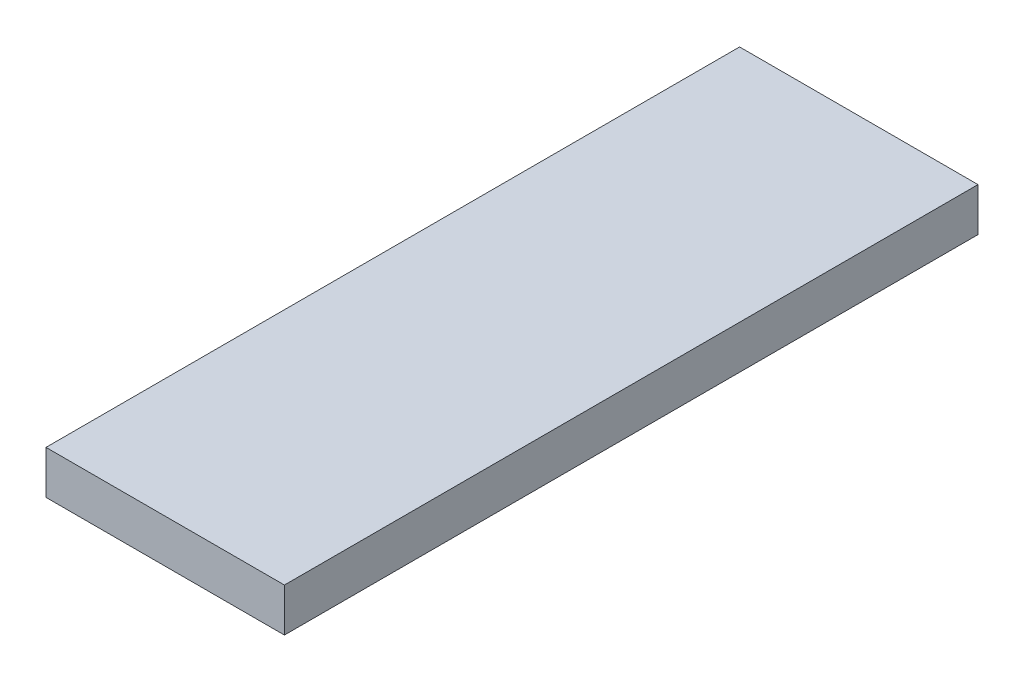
ISO-10303-21;
HEADER;
FILE_DESCRIPTION(('STEP AP214'),'2;1');
FILE_NAME('part.step','',(''),(''),'','','');
FILE_SCHEMA(('AUTOMOTIVE_DESIGN { 1 0 10303 214 1 1 1 1 }'));
ENDSEC;
DATA;
#1=APPLICATION_CONTEXT('core data for automotive mechanical design processes');
#2=APPLICATION_PROTOCOL_DEFINITION('international standard','automotive_design',2000,#1);
#3=PRODUCT_CONTEXT('',#1,'mechanical');
#4=PRODUCT('Part','Part','',(#3));
#5=PRODUCT_RELATED_PRODUCT_CATEGORY('part','',(#4));
#6=PRODUCT_DEFINITION_FORMATION('','',#4);
#7=PRODUCT_DEFINITION_CONTEXT('part definition',#1,'design');
#8=PRODUCT_DEFINITION('design','',#6,#7);
#9=PRODUCT_DEFINITION_SHAPE('','',#8);
#10=(LENGTH_UNIT() NAMED_UNIT(*) SI_UNIT(.MILLI.,.METRE.));
#11=(NAMED_UNIT(*) PLANE_ANGLE_UNIT() SI_UNIT($,.RADIAN.));
#12=(NAMED_UNIT(*) SI_UNIT($,.STERADIAN.) SOLID_ANGLE_UNIT());
#13=UNCERTAINTY_MEASURE_WITH_UNIT(LENGTH_MEASURE(1.E-05),#10,'distance_accuracy_value','');
#14=(GEOMETRIC_REPRESENTATION_CONTEXT(3) GLOBAL_UNCERTAINTY_ASSIGNED_CONTEXT((#13)) GLOBAL_UNIT_ASSIGNED_CONTEXT((#10,
#11,#12)) REPRESENTATION_CONTEXT('',''));
#15=CARTESIAN_POINT('',(0.,0.,0.));
#16=DIRECTION('',(0.,0.,1.));
#17=DIRECTION('',(1.,0.,0.));
#18=AXIS2_PLACEMENT_3D('',#15,#16,#17);
#19=CARTESIAN_POINT('',(0.,10.,0.));
#20=DIRECTION('',(1.,0.,0.));
#21=DIRECTION('',(0.,0.,-1.));
#22=AXIS2_PLACEMENT_3D('',#19,#20,#21);
#23=PLANE('',#22);
#24=DIRECTION('',(0.,0.,1.));
#25=VECTOR('',#24,1.);
#26=CARTESIAN_POINT('',(0.,0.,0.));
#27=LINE('',#26,#25);
#28=CARTESIAN_POINT('',(0.,0.,-160.));
#29=VERTEX_POINT('',#28);
#30=CARTESIAN_POINT('',(0.,0.,0.));
#31=VERTEX_POINT('',#30);
#32=EDGE_CURVE('E111',#29,#31,#27,.T.);
#33=ORIENTED_EDGE('',*,*,#32,.T.);
#34=DIRECTION('',(0.,-1.,0.));
#35=VECTOR('',#34,1.);
#36=CARTESIAN_POINT('',(0.,10.,0.));
#37=LINE('',#36,#35);
#38=CARTESIAN_POINT('',(0.,10.,0.));
#39=VERTEX_POINT('',#38);
#40=EDGE_CURVE('E11',#39,#31,#37,.T.);
#41=ORIENTED_EDGE('',*,*,#40,.F.);
#42=DIRECTION('',(0.,0.,1.));
#43=VECTOR('',#42,1.);
#44=CARTESIAN_POINT('',(0.,10.,0.));
#45=LINE('',#44,#43);
#46=CARTESIAN_POINT('',(0.,10.,-160.));
#47=VERTEX_POINT('',#46);
#48=EDGE_CURVE('E95',#47,#39,#45,.T.);
#49=ORIENTED_EDGE('',*,*,#48,.F.);
#50=DIRECTION('',(0.,-1.,0.));
#51=VECTOR('',#50,1.);
#52=CARTESIAN_POINT('',(0.,10.,-160.));
#53=LINE('',#52,#51);
#54=EDGE_CURVE('E107',#47,#29,#53,.T.);
#55=ORIENTED_EDGE('',*,*,#54,.T.);
#56=EDGE_LOOP('',(#33,#41,#49,#55));
#57=FACE_BOUND('',#56,.T.);
#58=ADVANCED_FACE('F43',(#57),#23,.F.);
#59=CARTESIAN_POINT('',(0.,10.,0.));
#60=DIRECTION('',(0.,0.,-1.));
#61=DIRECTION('',(-1.,0.,0.));
#62=AXIS2_PLACEMENT_3D('',#59,#60,#61);
#63=PLANE('',#62);
#64=DIRECTION('',(1.,0.,0.));
#65=VECTOR('',#64,1.);
#66=CARTESIAN_POINT('',(0.,0.,0.));
#67=LINE('',#66,#65);
#68=CARTESIAN_POINT('',(55.,0.,0.));
#69=VERTEX_POINT('',#68);
#70=EDGE_CURVE('E100',#31,#69,#67,.T.);
#71=ORIENTED_EDGE('',*,*,#70,.T.);
#72=DIRECTION('',(0.,-1.,0.));
#73=VECTOR('',#72,1.);
#74=CARTESIAN_POINT('',(55.,10.,0.));
#75=LINE('',#74,#73);
#76=CARTESIAN_POINT('',(55.,10.,0.));
#77=VERTEX_POINT('',#76);
#78=EDGE_CURVE('E52',#77,#69,#75,.T.);
#79=ORIENTED_EDGE('',*,*,#78,.F.);
#80=DIRECTION('',(1.,0.,0.));
#81=VECTOR('',#80,1.);
#82=CARTESIAN_POINT('',(0.,10.,0.));
#83=LINE('',#82,#81);
#84=EDGE_CURVE('E90',#39,#77,#83,.T.);
#85=ORIENTED_EDGE('',*,*,#84,.F.);
#86=ORIENTED_EDGE('',*,*,#40,.T.);
#87=EDGE_LOOP('',(#71,#79,#85,#86));
#88=FACE_BOUND('',#87,.T.);
#89=ADVANCED_FACE('F99',(#88),#63,.F.);
#90=CARTESIAN_POINT('',(55.,10.,0.));
#91=DIRECTION('',(-1.,0.,0.));
#92=DIRECTION('',(0.,0.,1.));
#93=AXIS2_PLACEMENT_3D('',#90,#91,#92);
#94=PLANE('',#93);
#95=DIRECTION('',(0.,0.,-1.));
#96=VECTOR('',#95,1.);
#97=CARTESIAN_POINT('',(55.,0.,0.));
#98=LINE('',#97,#96);
#99=CARTESIAN_POINT('',(55.,0.,-160.));
#100=VERTEX_POINT('',#99);
#101=EDGE_CURVE('E77',#69,#100,#98,.T.);
#102=ORIENTED_EDGE('',*,*,#101,.T.);
#103=DIRECTION('',(0.,-1.,0.));
#104=VECTOR('',#103,1.);
#105=CARTESIAN_POINT('',(55.,10.,-160.));
#106=LINE('',#105,#104);
#107=CARTESIAN_POINT('',(55.,10.,-160.));
#108=VERTEX_POINT('',#107);
#109=EDGE_CURVE('E102',#108,#100,#106,.T.);
#110=ORIENTED_EDGE('',*,*,#109,.F.);
#111=DIRECTION('',(0.,0.,-1.));
#112=VECTOR('',#111,1.);
#113=CARTESIAN_POINT('',(55.,10.,0.));
#114=LINE('',#113,#112);
#115=EDGE_CURVE('E93',#77,#108,#114,.T.);
#116=ORIENTED_EDGE('',*,*,#115,.F.);
#117=ORIENTED_EDGE('',*,*,#78,.T.);
#118=EDGE_LOOP('',(#102,#110,#116,#117));
#119=FACE_BOUND('',#118,.T.);
#120=ADVANCED_FACE('F103',(#119),#94,.F.);
#121=CARTESIAN_POINT('',(0.,10.,-160.));
#122=DIRECTION('',(0.,0.,1.));
#123=DIRECTION('',(1.,0.,0.));
#124=AXIS2_PLACEMENT_3D('',#121,#122,#123);
#125=PLANE('',#124);
#126=DIRECTION('',(-1.,0.,0.));
#127=VECTOR('',#126,1.);
#128=CARTESIAN_POINT('',(0.,0.,-160.));
#129=LINE('',#128,#127);
#130=EDGE_CURVE('E83',#100,#29,#129,.T.);
#131=ORIENTED_EDGE('',*,*,#130,.T.);
#132=ORIENTED_EDGE('',*,*,#54,.F.);
#133=DIRECTION('',(-1.,0.,0.));
#134=VECTOR('',#133,1.);
#135=CARTESIAN_POINT('',(0.,10.,-160.));
#136=LINE('',#135,#134);
#137=EDGE_CURVE('E60',#108,#47,#136,.T.);
#138=ORIENTED_EDGE('',*,*,#137,.F.);
#139=ORIENTED_EDGE('',*,*,#109,.T.);
#140=EDGE_LOOP('',(#131,#132,#138,#139));
#141=FACE_BOUND('',#140,.T.);
#142=ADVANCED_FACE('F124',(#141),#125,.F.);
#143=CARTESIAN_POINT('',(0.,10.,0.));
#144=DIRECTION('',(0.,-1.,0.));
#145=DIRECTION('',(0.,0.,-1.));
#146=AXIS2_PLACEMENT_3D('',#143,#144,#145);
#147=PLANE('',#146);
#148=ORIENTED_EDGE('',*,*,#48,.T.);
#149=ORIENTED_EDGE('',*,*,#84,.T.);
#150=ORIENTED_EDGE('',*,*,#115,.T.);
#151=ORIENTED_EDGE('',*,*,#137,.T.);
#152=EDGE_LOOP('',(#148,#149,#150,#151));
#153=FACE_BOUND('',#152,.T.);
#154=ADVANCED_FACE('F91',(#153),#147,.F.);
#155=CARTESIAN_POINT('',(0.,0.,0.));
#156=DIRECTION('',(0.,-1.,0.));
#157=DIRECTION('',(0.,0.,-1.));
#158=AXIS2_PLACEMENT_3D('',#155,#156,#157);
#159=PLANE('',#158);
#160=ORIENTED_EDGE('',*,*,#32,.F.);
#161=ORIENTED_EDGE('',*,*,#130,.F.);
#162=ORIENTED_EDGE('',*,*,#101,.F.);
#163=ORIENTED_EDGE('',*,*,#70,.F.);
#164=EDGE_LOOP('',(#160,#161,#162,#163));
#165=FACE_BOUND('',#164,.T.);
#166=ADVANCED_FACE('F127',(#165),#159,.T.);
#167=CLOSED_SHELL('',(#58,#89,#120,#142,#154,#166));
#168=MANIFOLD_SOLID_BREP('B2',#167);
#169=ADVANCED_BREP_SHAPE_REPRESENTATION('',(#18,#168),#14);
#170=SHAPE_DEFINITION_REPRESENTATION(#9,#169);
ENDSEC;
END-ISO-10303-21;
